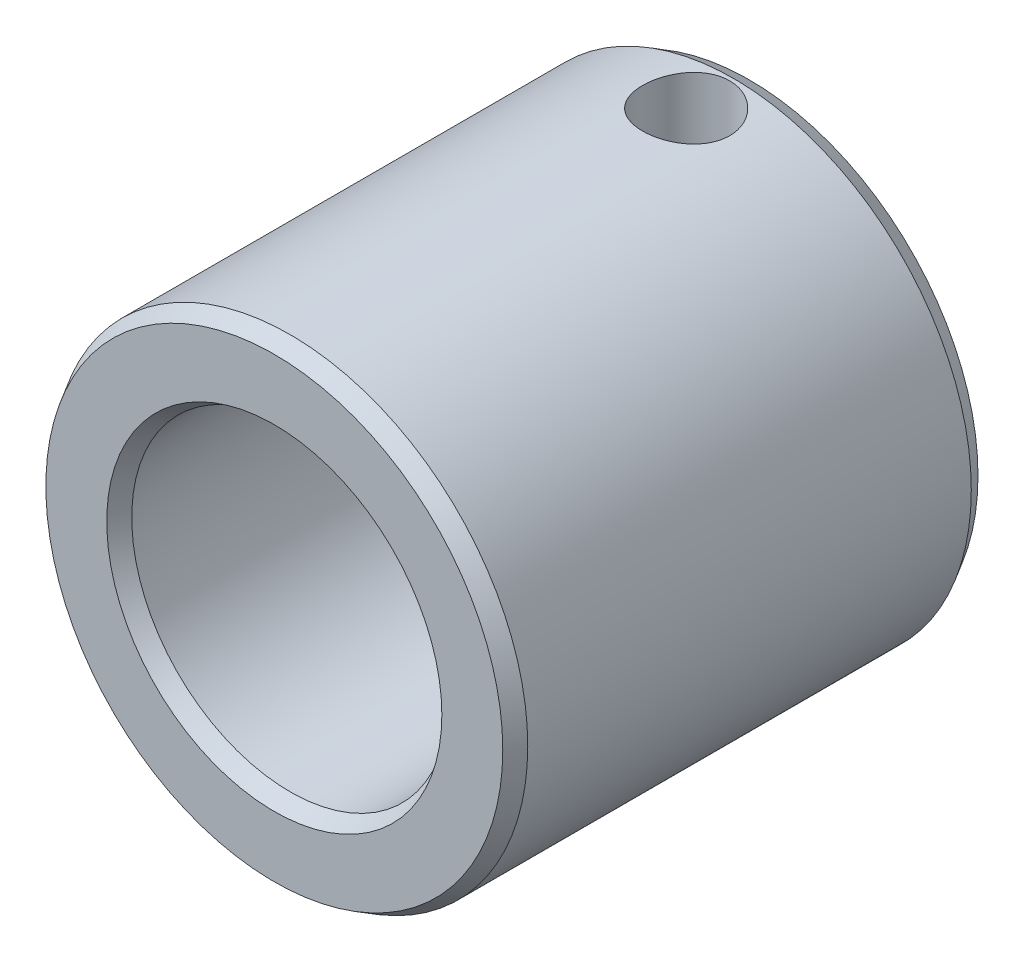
ISO-10303-21;
HEADER;
FILE_DESCRIPTION(('STEP AP214'),'2;1');
FILE_NAME('part.step','',(''),(''),'','','');
FILE_SCHEMA(('AUTOMOTIVE_DESIGN { 1 0 10303 214 1 1 1 1 }'));
ENDSEC;
DATA;
#1=APPLICATION_CONTEXT('core data for automotive mechanical design processes');
#2=APPLICATION_PROTOCOL_DEFINITION('international standard','automotive_design',2000,#1);
#3=PRODUCT_CONTEXT('',#1,'mechanical');
#4=PRODUCT('Part','Part','',(#3));
#5=PRODUCT_RELATED_PRODUCT_CATEGORY('part','',(#4));
#6=PRODUCT_DEFINITION_FORMATION('','',#4);
#7=PRODUCT_DEFINITION_CONTEXT('part definition',#1,'design');
#8=PRODUCT_DEFINITION('design','',#6,#7);
#9=PRODUCT_DEFINITION_SHAPE('','',#8);
#10=(LENGTH_UNIT() NAMED_UNIT(*) SI_UNIT(.MILLI.,.METRE.));
#11=(NAMED_UNIT(*) PLANE_ANGLE_UNIT() SI_UNIT($,.RADIAN.));
#12=(NAMED_UNIT(*) SI_UNIT($,.STERADIAN.) SOLID_ANGLE_UNIT());
#13=UNCERTAINTY_MEASURE_WITH_UNIT(LENGTH_MEASURE(1.E-05),#10,'distance_accuracy_value','');
#14=(GEOMETRIC_REPRESENTATION_CONTEXT(3) GLOBAL_UNCERTAINTY_ASSIGNED_CONTEXT((#13)) GLOBAL_UNIT_ASSIGNED_CONTEXT((#10,
#11,#12)) REPRESENTATION_CONTEXT('',''));
#15=CARTESIAN_POINT('',(0.,0.,0.));
#16=DIRECTION('',(0.,0.,1.));
#17=DIRECTION('',(1.,0.,0.));
#18=AXIS2_PLACEMENT_3D('',#15,#16,#17);
#19=CARTESIAN_POINT('',(0.,0.,34.824721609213));
#20=DIRECTION('',(0.,0.,1.));
#21=DIRECTION('',(1.,0.,0.));
#22=AXIS2_PLACEMENT_3D('',#19,#20,#21);
#23=CYLINDRICAL_SURFACE('',#22,10.);
#24=CARTESIAN_POINT('',(0.,0.,29.));
#25=DIRECTION('',(0.,0.,1.));
#26=DIRECTION('',(1.,0.,0.));
#27=AXIS2_PLACEMENT_3D('',#24,#25,#26);
#28=CIRCLE('',#27,10.);
#29=CARTESIAN_POINT('',(10.,0.,29.));
#30=VERTEX_POINT('',#29);
#31=EDGE_CURVE('E29',#30,#30,#28,.T.);
#32=ORIENTED_EDGE('',*,*,#31,.T.);
#33=EDGE_LOOP('',(#32));
#34=FACE_BOUND('',#33,.T.);
#35=CARTESIAN_POINT('',(0.,0.,1.));
#36=DIRECTION('',(0.,0.,1.));
#37=DIRECTION('',(1.,0.,0.));
#38=AXIS2_PLACEMENT_3D('',#35,#36,#37);
#39=CIRCLE('',#38,10.);
#40=CARTESIAN_POINT('',(10.,0.,1.));
#41=VERTEX_POINT('',#40);
#42=EDGE_CURVE('E34',#41,#41,#39,.T.);
#43=ORIENTED_EDGE('',*,*,#42,.F.);
#44=EDGE_LOOP('',(#43));
#45=FACE_BOUND('',#44,.T.);
#46=CARTESIAN_POINT('',(0.,10.,6.75));
#47=CARTESIAN_POINT('',(0.15142288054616,9.99999790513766,6.74999678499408));
#48=CARTESIAN_POINT('',(0.30287955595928,9.99652704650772,6.73745149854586));
#49=CARTESIAN_POINT('',(0.60141835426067,9.9830186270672,6.68769783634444));
#50=CARTESIAN_POINT('',(0.748498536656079,9.97297819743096,6.65047868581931));
#51=CARTESIAN_POINT('',(1.03393279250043,9.94743692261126,6.5526875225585));
#52=CARTESIAN_POINT('',(1.17229822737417,9.93194336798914,6.49214667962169));
#53=CARTESIAN_POINT('',(1.43691255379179,9.89712668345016,6.34954921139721));
#54=CARTESIAN_POINT('',(1.56316043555,9.87780323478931,6.26749079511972));
#55=CARTESIAN_POINT('',(1.80305227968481,9.83687707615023,6.082063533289));
#56=CARTESIAN_POINT('',(1.91635675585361,9.81523348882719,5.97826450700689));
#57=CARTESIAN_POINT('',(2.12418937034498,9.77236429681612,5.75322139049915));
#58=CARTESIAN_POINT('',(2.21871492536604,9.75113874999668,5.63197490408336));
#59=CARTESIAN_POINT('',(2.3879928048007,9.71108741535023,5.37273000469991));
#60=CARTESIAN_POINT('',(2.46234890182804,9.69231302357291,5.23446419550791));
#61=CARTESIAN_POINT('',(2.58662289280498,9.65989315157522,4.94679319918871));
#62=CARTESIAN_POINT('',(2.63654561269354,9.64624665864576,4.797390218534));
#63=CARTESIAN_POINT('',(2.70934583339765,9.62605068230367,4.49545889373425));
#64=CARTESIAN_POINT('',(2.73284141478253,9.61933931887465,4.34309067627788));
#65=CARTESIAN_POINT('',(2.75404817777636,9.61329031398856,4.03643877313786));
#66=CARTESIAN_POINT('',(2.75176451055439,9.61395119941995,3.88215547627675));
#67=CARTESIAN_POINT('',(2.72196703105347,9.62242747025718,3.58092425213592));
#68=CARTESIAN_POINT('',(2.69520726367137,9.63002901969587,3.43389475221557));
#69=CARTESIAN_POINT('',(2.61842742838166,9.6511868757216,3.14649742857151));
#70=CARTESIAN_POINT('',(2.56840539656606,9.66474368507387,3.00613016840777));
#71=CARTESIAN_POINT('',(2.4459209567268,9.6964683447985,2.73410558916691));
#72=CARTESIAN_POINT('',(2.37319900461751,9.71468906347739,2.60257156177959));
#73=CARTESIAN_POINT('',(2.20755990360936,9.75366083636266,2.3533115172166));
#74=CARTESIAN_POINT('',(2.11463855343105,9.77441241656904,2.23558838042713));
#75=CARTESIAN_POINT('',(1.90740929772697,9.81699239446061,2.01299085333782));
#76=CARTESIAN_POINT('',(1.79246989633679,9.83883313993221,1.90870584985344));
#77=CARTESIAN_POINT('',(1.54646529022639,9.8804850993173,1.7207665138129));
#78=CARTESIAN_POINT('',(1.41539936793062,9.90029622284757,1.63711309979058));
#79=CARTESIAN_POINT('',(1.13991171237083,9.93579173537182,1.49252903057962));
#80=CARTESIAN_POINT('',(0.995428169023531,9.95145560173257,1.43171077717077));
#81=CARTESIAN_POINT('',(0.69775688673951,9.97674362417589,1.33540050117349));
#82=CARTESIAN_POINT('',(0.544571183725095,9.98636918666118,1.29990258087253));
#83=CARTESIAN_POINT('',(0.238869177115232,9.99828101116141,1.25617934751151));
#84=CARTESIAN_POINT('',(0.0864756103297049,10.0007826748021,1.24715335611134));
#85=CARTESIAN_POINT('',(-0.217649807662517,9.9987871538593,1.25441110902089));
#86=CARTESIAN_POINT('',(-0.369381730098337,9.99429074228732,1.27069205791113));
#87=CARTESIAN_POINT('',(-0.664979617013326,9.97894393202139,1.32744676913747));
#88=CARTESIAN_POINT('',(-0.808939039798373,9.9682122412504,1.36746883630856));
#89=CARTESIAN_POINT('',(-1.0880827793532,9.94161719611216,1.47004065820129));
#90=CARTESIAN_POINT('',(-1.22326611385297,9.92575326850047,1.53259292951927));
#91=CARTESIAN_POINT('',(-1.48409215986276,9.89015496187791,1.67990036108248));
#92=CARTESIAN_POINT('',(-1.60948250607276,9.8703479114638,1.76508435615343));
#93=CARTESIAN_POINT('',(-1.84446827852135,9.82915015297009,1.95470256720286));
#94=CARTESIAN_POINT('',(-1.95406037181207,9.80775911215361,2.05914083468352));
#95=CARTESIAN_POINT('',(-2.15775026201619,9.76500318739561,2.28804742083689));
#96=CARTESIAN_POINT('',(-2.25128173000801,9.74365851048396,2.41302443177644));
#97=CARTESIAN_POINT('',(-2.41606367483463,9.70411480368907,2.67735585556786));
#98=CARTESIAN_POINT('',(-2.48731502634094,9.68591565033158,2.81670970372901));
#99=CARTESIAN_POINT('',(-2.60498194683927,9.65493519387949,3.1051872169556));
#100=CARTESIAN_POINT('',(-2.65153712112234,9.64212352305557,3.25425049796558));
#101=CARTESIAN_POINT('',(-2.71879365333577,9.62337795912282,3.55850589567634));
#102=CARTESIAN_POINT('',(-2.73950213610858,9.61744217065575,3.71369631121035));
#103=CARTESIAN_POINT('',(-2.75404886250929,9.6132857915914,4.01998313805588));
#104=CARTESIAN_POINT('',(-2.7488002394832,9.614803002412,4.17103325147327));
#105=CARTESIAN_POINT('',(-2.71371466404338,9.62476380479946,4.47000569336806));
#106=CARTESIAN_POINT('',(-2.68387842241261,9.63320719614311,4.6179281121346));
#107=CARTESIAN_POINT('',(-2.60100915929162,9.65590796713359,4.90521496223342));
#108=CARTESIAN_POINT('',(-2.54818121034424,9.67011387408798,5.04464290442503));
#109=CARTESIAN_POINT('',(-2.4209868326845,9.70273746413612,5.31276434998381));
#110=CARTESIAN_POINT('',(-2.34661683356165,9.72115584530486,5.44145606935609));
#111=CARTESIAN_POINT('',(-2.17573113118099,9.76084545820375,5.68878195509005));
#112=CARTESIAN_POINT('',(-2.07859788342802,9.78218767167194,5.80697809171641));
#113=CARTESIAN_POINT('',(-1.86610223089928,9.82493707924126,6.02568951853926));
#114=CARTESIAN_POINT('',(-1.75073533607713,9.84634428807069,6.12620044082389));
#115=CARTESIAN_POINT('',(-1.50182041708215,9.88740569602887,6.30898765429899));
#116=CARTESIAN_POINT('',(-1.36791284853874,9.907007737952,6.39078709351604));
#117=CARTESIAN_POINT('',(-1.08770978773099,9.94166772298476,6.53058644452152));
#118=CARTESIAN_POINT('',(-0.941421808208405,9.95672839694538,6.58860066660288));
#119=CARTESIAN_POINT('',(-0.66319943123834,9.97880995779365,6.67217272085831));
#120=CARTESIAN_POINT('',(-0.532391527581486,9.9866965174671,6.70128757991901));
#121=CARTESIAN_POINT('',(-0.267730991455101,9.9972921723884,6.74020155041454));
#122=CARTESIAN_POINT('',(-0.13387870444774,10.0000018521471,6.75000284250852));
#123=CARTESIAN_POINT('',(0.,10.,6.75));
#124=B_SPLINE_CURVE_WITH_KNOTS('',3,(#46,#47,#48,#49,#50,#51,#52,#53,#54,#55,#56,#57,#58,#59,
#60,#61,#62,#63,#64,#65,#66,#67,#68,#69,#70,#71,#72,#73,#74,#75,#76,#77,#78,#79,#80,#81,#82,#83,
#84,#85,#86,#87,#88,#89,#90,#91,#92,#93,#94,#95,#96,#97,#98,#99,#100,#101,#102,#103,#104,#105,
#106,#107,#108,#109,#110,#111,#112,#113,#114,#115,#116,#117,#118,#119,#120,#121,#122,#123),
.UNSPECIFIED.,.T.,.F.,(4,2,2,2,2,2,2,2,2,2,2,2,2,2,2,2,2,2,2,2,2,2,2,2,2,2,2,2,2,2,2,2,2,2,2,2,
2,2,4),(0.,0.45377748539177,0.907753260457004,1.36112438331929,1.81453325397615,
2.27794447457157,2.74141939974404,3.21343018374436,3.68534770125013,4.14598225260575,
4.60652476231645,5.0533402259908,5.50019341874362,5.95235548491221,6.40461168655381,
6.87259959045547,7.34060832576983,7.81089145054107,8.28106499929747,8.73686293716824,
9.19261053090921,9.63995333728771,10.0873461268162,10.5439096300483,11.0005693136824,
11.4709880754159,11.9413883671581,12.4091004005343,12.8766834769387,13.3279371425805,
13.7791777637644,14.2264735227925,14.6738434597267,15.1351456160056,15.5965615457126,
16.0686764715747,16.5405069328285,16.9417541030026,17.3429559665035),.UNSPECIFIED.);
#125=CARTESIAN_POINT('',(0.,10.,6.75));
#126=VERTEX_POINT('',#125);
#127=EDGE_CURVE('E49',#126,#126,#124,.T.);
#128=ORIENTED_EDGE('',*,*,#127,.T.);
#129=EDGE_LOOP('',(#128));
#130=FACE_BOUND('',#129,.T.);
#131=ADVANCED_FACE('F12',(#34,#45,#130),#23,.F.);
#132=CARTESIAN_POINT('',(0.,0.,34.824721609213));
#133=DIRECTION('',(0.,0.,1.));
#134=DIRECTION('',(1.,0.,0.));
#135=AXIS2_PLACEMENT_3D('',#132,#133,#134);
#136=CYLINDRICAL_SURFACE('',#135,15.);
#137=CARTESIAN_POINT('',(0.,0.,29.));
#138=DIRECTION('',(0.,0.,1.));
#139=DIRECTION('',(1.,0.,0.));
#140=AXIS2_PLACEMENT_3D('',#137,#138,#139);
#141=CIRCLE('',#140,15.);
#142=CARTESIAN_POINT('',(15.,0.,29.));
#143=VERTEX_POINT('',#142);
#144=EDGE_CURVE('E46',#143,#143,#141,.T.);
#145=ORIENTED_EDGE('',*,*,#144,.F.);
#146=EDGE_LOOP('',(#145));
#147=FACE_BOUND('',#146,.T.);
#148=CARTESIAN_POINT('',(0.,0.,1.));
#149=DIRECTION('',(0.,0.,1.));
#150=DIRECTION('',(1.,0.,0.));
#151=AXIS2_PLACEMENT_3D('',#148,#149,#150);
#152=CIRCLE('',#151,15.);
#153=CARTESIAN_POINT('',(15.,0.,1.));
#154=VERTEX_POINT('',#153);
#155=EDGE_CURVE('E43',#154,#154,#152,.T.);
#156=ORIENTED_EDGE('',*,*,#155,.T.);
#157=EDGE_LOOP('',(#156));
#158=FACE_BOUND('',#157,.T.);
#159=CARTESIAN_POINT('',(0.,15.,6.75));
#160=CARTESIAN_POINT('',(-0.153093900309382,14.9999972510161,6.74999408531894));
#161=CARTESIAN_POINT('',(-0.306265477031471,14.9976319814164,6.73717257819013));
#162=CARTESIAN_POINT('',(-0.608296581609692,14.9884243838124,6.68625588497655));
#163=CARTESIAN_POINT('',(-0.757152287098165,14.9815782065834,6.64813896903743));
#164=CARTESIAN_POINT('',(-1.04613957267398,14.9641750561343,6.54783432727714));
#165=CARTESIAN_POINT('',(-1.18627875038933,14.9536213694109,6.48566791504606));
#166=CARTESIAN_POINT('',(-1.45412377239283,14.9299573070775,6.3390885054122));
#167=CARTESIAN_POINT('',(-1.58183070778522,14.9168471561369,6.25467746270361));
#168=CARTESIAN_POINT('',(-1.82266517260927,14.8893503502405,6.06497648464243));
#169=CARTESIAN_POINT('',(-1.93562942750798,14.8749519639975,5.95948094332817));
#170=CARTESIAN_POINT('',(-2.1423598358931,14.846589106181,5.73104795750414));
#171=CARTESIAN_POINT('',(-2.23612464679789,14.8326246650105,5.60810929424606));
#172=CARTESIAN_POINT('',(-2.40246850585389,14.806596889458,5.34713263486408));
#173=CARTESIAN_POINT('',(-2.47488242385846,14.7945486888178,5.20898774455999));
#174=CARTESIAN_POINT('',(-2.59541207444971,14.7738823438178,4.922235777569));
#175=CARTESIAN_POINT('',(-2.64352980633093,14.7652639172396,4.77362956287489));
#176=CARTESIAN_POINT('',(-2.71357916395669,14.7525507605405,4.47191708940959));
#177=CARTESIAN_POINT('',(-2.73579495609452,14.7484069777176,4.31887891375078));
#178=CARTESIAN_POINT('',(-2.75429164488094,14.7449642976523,4.01119549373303));
#179=CARTESIAN_POINT('',(-2.75057476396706,14.7456649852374,3.8565503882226));
#180=CARTESIAN_POINT('',(-2.71754225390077,14.7517873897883,3.55209529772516));
#181=CARTESIAN_POINT('',(-2.68854893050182,14.7571496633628,3.40224897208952));
#182=CARTESIAN_POINT('',(-2.60629376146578,14.7718977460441,3.1095840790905));
#183=CARTESIAN_POINT('',(-2.55303092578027,14.7812837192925,2.96676579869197));
#184=CARTESIAN_POINT('',(-2.42343106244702,14.8030842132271,2.69126347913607));
#185=CARTESIAN_POINT('',(-2.34696312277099,14.8155158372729,2.5586424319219));
#186=CARTESIAN_POINT('',(-2.17321635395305,14.841995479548,2.3079923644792));
#187=CARTESIAN_POINT('',(-2.0759355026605,14.8560436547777,2.18996476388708));
#188=CARTESIAN_POINT('',(-1.86158278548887,14.8844329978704,1.96998902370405));
#189=CARTESIAN_POINT('',(-1.74423505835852,14.8987753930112,1.86830966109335));
#190=CARTESIAN_POINT('',(-1.4940048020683,14.925942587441,1.68604048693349));
#191=CARTESIAN_POINT('',(-1.36112212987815,14.9387673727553,1.6054508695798));
#192=CARTESIAN_POINT('',(-1.08331945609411,14.9614785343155,1.46761241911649));
#193=CARTESIAN_POINT('',(-0.9383857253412,14.9713614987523,1.4103906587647));
#194=CARTESIAN_POINT('',(-0.640742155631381,14.9870489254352,1.32117929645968));
#195=CARTESIAN_POINT('',(-0.488033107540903,14.9928538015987,1.28918713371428));
#196=CARTESIAN_POINT('',(-0.181487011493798,14.999674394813,1.25171517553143));
#197=CARTESIAN_POINT('',(-0.0276964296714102,15.0007566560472,1.24586696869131));
#198=CARTESIAN_POINT('',(0.27866544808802,14.9981935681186,1.25986196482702));
#199=CARTESIAN_POINT('',(0.431236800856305,14.9945484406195,1.27970396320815));
#200=CARTESIAN_POINT('',(0.729667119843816,14.9829815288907,1.34420979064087));
#201=CARTESIAN_POINT('',(0.87556754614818,14.9750917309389,1.38868804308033));
#202=CARTESIAN_POINT('',(1.15784057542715,14.9559164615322,1.501003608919));
#203=CARTESIAN_POINT('',(1.2942125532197,14.9446307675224,1.56884245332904));
#204=CARTESIAN_POINT('',(1.55513574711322,14.9197496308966,1.72677482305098));
#205=CARTESIAN_POINT('',(1.67954783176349,14.9061311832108,1.81709451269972));
#206=CARTESIAN_POINT('',(1.91158174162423,14.8781564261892,2.01711764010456));
#207=CARTESIAN_POINT('',(2.01920207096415,14.8638000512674,2.12682280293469));
#208=CARTESIAN_POINT('',(2.21599031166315,14.8357478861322,2.3641674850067));
#209=CARTESIAN_POINT('',(2.30490730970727,14.8220627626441,2.49201651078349));
#210=CARTESIAN_POINT('',(2.46000320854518,14.7971139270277,2.76105288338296));
#211=CARTESIAN_POINT('',(2.52618293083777,14.7858501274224,2.90223974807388));
#212=CARTESIAN_POINT('',(2.63356582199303,14.7671022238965,3.19329356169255));
#213=CARTESIAN_POINT('',(2.67488605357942,14.7596004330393,3.34311612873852));
#214=CARTESIAN_POINT('',(2.73173972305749,14.7491846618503,3.6477269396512));
#215=CARTESIAN_POINT('',(2.74727592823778,14.746270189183,3.80251464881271));
#216=CARTESIAN_POINT('',(2.75203112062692,14.7453832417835,4.11015028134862));
#217=CARTESIAN_POINT('',(2.74164570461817,14.7473364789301,4.26299201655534));
#218=CARTESIAN_POINT('',(2.69571632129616,14.7558005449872,4.5647121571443));
#219=CARTESIAN_POINT('',(2.66017248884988,14.7623113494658,4.71359058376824));
#220=CARTESIAN_POINT('',(2.56509900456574,14.77912629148,5.00295766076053));
#221=CARTESIAN_POINT('',(2.50561036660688,14.7894239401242,5.14346018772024));
#222=CARTESIAN_POINT('',(2.36437859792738,14.8126571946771,5.41255379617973));
#223=CARTESIAN_POINT('',(2.28263399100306,14.8255929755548,5.54114408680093));
#224=CARTESIAN_POINT('',(2.09782771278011,14.8528765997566,5.78474827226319));
#225=CARTESIAN_POINT('',(1.99447745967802,14.8672420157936,5.89954130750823));
#226=CARTESIAN_POINT('',(1.76999701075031,14.8956330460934,6.11028811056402));
#227=CARTESIAN_POINT('',(1.64886273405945,14.9096585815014,6.2062375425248));
#228=CARTESIAN_POINT('',(1.39101348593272,14.9359299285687,6.37733686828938));
#229=CARTESIAN_POINT('',(1.25417414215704,14.9481594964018,6.45230189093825));
#230=CARTESIAN_POINT('',(0.969665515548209,14.9693025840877,6.57805965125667));
#231=CARTESIAN_POINT('',(0.822006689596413,14.9782192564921,6.62887538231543));
#232=CARTESIAN_POINT('',(0.561569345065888,14.9898870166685,6.69442423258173));
#233=CARTESIAN_POINT('',(0.450325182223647,14.9936582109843,6.71523000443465));
#234=CARTESIAN_POINT('',(0.226068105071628,14.9987156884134,6.74301990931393));
#235=CARTESIAN_POINT('',(0.113055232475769,15.0000020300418,6.75000436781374));
#236=CARTESIAN_POINT('',(0.,15.,6.75));
#237=B_SPLINE_CURVE_WITH_KNOTS('',3,(#159,#160,#161,#162,#163,#164,#165,#166,#167,#168,#169,
#170,#171,#172,#173,#174,#175,#176,#177,#178,#179,#180,#181,#182,#183,#184,#185,#186,#187,#188,
#189,#190,#191,#192,#193,#194,#195,#196,#197,#198,#199,#200,#201,#202,#203,#204,#205,#206,#207,
#208,#209,#210,#211,#212,#213,#214,#215,#216,#217,#218,#219,#220,#221,#222,#223,#224,#225,#226,
#227,#228,#229,#230,#231,#232,#233,#234,#235,#236),.UNSPECIFIED.,.T.,.F.,(4,2,2,2,2,2,2,2,2,2,2,
2,2,2,2,2,2,2,2,2,2,2,2,2,2,2,2,2,2,2,2,2,2,2,2,2,2,2,4),(0.,0.45886829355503,0.918131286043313,
1.3769881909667,1.83580478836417,2.29933541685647,2.76289844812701,3.229957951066,
3.69697901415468,4.15882675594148,4.62063491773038,5.07663918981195,5.53266206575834,
5.9913070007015,6.44999651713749,6.91559042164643,7.38118861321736,7.8473247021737,
8.31341347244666,8.77291314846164,9.23239127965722,9.68845448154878,10.1445475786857,
10.6054289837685,11.0663514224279,11.5331103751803,11.9998524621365,12.4643791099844,
12.9288558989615,13.3862876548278,13.8437169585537,14.3003660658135,14.757045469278,
15.2202665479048,15.6835940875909,16.1508835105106,16.6177271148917,16.956595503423,
17.2954559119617),.UNSPECIFIED.);
#238=CARTESIAN_POINT('',(0.,15.,6.75));
#239=VERTEX_POINT('',#238);
#240=EDGE_CURVE('E16',#239,#239,#237,.T.);
#241=ORIENTED_EDGE('',*,*,#240,.T.);
#242=EDGE_LOOP('',(#241));
#243=FACE_BOUND('',#242,.T.);
#244=ADVANCED_FACE('F63',(#147,#158,#243),#136,.T.);
#245=CARTESIAN_POINT('',(0.,0.,29.));
#246=DIRECTION('',(0.,0.,-1.));
#247=DIRECTION('',(-1.,0.,0.));
#248=AXIS2_PLACEMENT_3D('',#245,#246,#247);
#249=CONICAL_SURFACE('',#248,15.,0.523598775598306);
#250=CARTESIAN_POINT('',(0.,0.,30.));
#251=DIRECTION('',(0.,0.,1.));
#252=DIRECTION('',(1.,0.,0.));
#253=AXIS2_PLACEMENT_3D('',#250,#251,#252);
#254=CIRCLE('',#253,14.4226497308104);
#255=CARTESIAN_POINT('',(14.4226497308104,0.,30.));
#256=VERTEX_POINT('',#255);
#257=EDGE_CURVE('E8',#256,#256,#254,.T.);
#258=ORIENTED_EDGE('',*,*,#257,.F.);
#259=EDGE_LOOP('',(#258));
#260=FACE_BOUND('',#259,.T.);
#261=ORIENTED_EDGE('',*,*,#144,.T.);
#262=EDGE_LOOP('',(#261));
#263=FACE_BOUND('',#262,.T.);
#264=ADVANCED_FACE('F14',(#260,#263),#249,.T.);
#265=CARTESIAN_POINT('',(0.,-10.5773502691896,30.));
#266=DIRECTION('',(0.,0.,1.));
#267=DIRECTION('',(1.,0.,0.));
#268=AXIS2_PLACEMENT_3D('',#265,#266,#267);
#269=PLANE('',#268);
#270=ORIENTED_EDGE('',*,*,#257,.T.);
#271=EDGE_LOOP('',(#270));
#272=FACE_BOUND('',#271,.T.);
#273=CARTESIAN_POINT('',(0.,0.,30.));
#274=DIRECTION('',(0.,0.,1.));
#275=DIRECTION('',(1.,0.,0.));
#276=AXIS2_PLACEMENT_3D('',#273,#274,#275);
#277=CIRCLE('',#276,10.5773502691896);
#278=CARTESIAN_POINT('',(10.5773502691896,0.,30.));
#279=VERTEX_POINT('',#278);
#280=EDGE_CURVE('E25',#279,#279,#277,.T.);
#281=ORIENTED_EDGE('',*,*,#280,.F.);
#282=EDGE_LOOP('',(#281));
#283=FACE_BOUND('',#282,.T.);
#284=ADVANCED_FACE('F84',(#272,#283),#269,.T.);
#285=CARTESIAN_POINT('',(0.,0.,29.));
#286=DIRECTION('',(0.,0.,1.));
#287=DIRECTION('',(1.,0.,0.));
#288=AXIS2_PLACEMENT_3D('',#285,#286,#287);
#289=CONICAL_SURFACE('',#288,10.,0.523598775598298);
#290=ORIENTED_EDGE('',*,*,#280,.T.);
#291=EDGE_LOOP('',(#290));
#292=FACE_BOUND('',#291,.T.);
#293=ORIENTED_EDGE('',*,*,#31,.F.);
#294=EDGE_LOOP('',(#293));
#295=FACE_BOUND('',#294,.T.);
#296=ADVANCED_FACE('F77',(#292,#295),#289,.F.);
#297=CARTESIAN_POINT('',(0.,0.,1.));
#298=DIRECTION('',(0.,0.,-1.));
#299=DIRECTION('',(-1.,0.,0.));
#300=AXIS2_PLACEMENT_3D('',#297,#298,#299);
#301=CONICAL_SURFACE('',#300,10.,0.523598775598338);
#302=CARTESIAN_POINT('',(0.,0.,0.));
#303=DIRECTION('',(0.,0.,1.));
#304=DIRECTION('',(1.,0.,0.));
#305=AXIS2_PLACEMENT_3D('',#302,#303,#304);
#306=CIRCLE('',#305,10.5773502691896);
#307=CARTESIAN_POINT('',(10.5773502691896,0.,0.));
#308=VERTEX_POINT('',#307);
#309=EDGE_CURVE('E37',#308,#308,#306,.T.);
#310=ORIENTED_EDGE('',*,*,#309,.F.);
#311=EDGE_LOOP('',(#310));
#312=FACE_BOUND('',#311,.T.);
#313=ORIENTED_EDGE('',*,*,#42,.T.);
#314=EDGE_LOOP('',(#313));
#315=FACE_BOUND('',#314,.T.);
#316=ADVANCED_FACE('F74',(#312,#315),#301,.F.);
#317=CARTESIAN_POINT('',(0.,-14.4226497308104,0.));
#318=DIRECTION('',(0.,0.,-1.));
#319=DIRECTION('',(-1.,0.,0.));
#320=AXIS2_PLACEMENT_3D('',#317,#318,#319);
#321=PLANE('',#320);
#322=ORIENTED_EDGE('',*,*,#309,.T.);
#323=EDGE_LOOP('',(#322));
#324=FACE_BOUND('',#323,.T.);
#325=CARTESIAN_POINT('',(0.,0.,0.));
#326=DIRECTION('',(0.,0.,1.));
#327=DIRECTION('',(1.,0.,0.));
#328=AXIS2_PLACEMENT_3D('',#325,#326,#327);
#329=CIRCLE('',#328,14.4226497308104);
#330=CARTESIAN_POINT('',(14.4226497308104,0.,0.));
#331=VERTEX_POINT('',#330);
#332=EDGE_CURVE('E40',#331,#331,#329,.T.);
#333=ORIENTED_EDGE('',*,*,#332,.F.);
#334=EDGE_LOOP('',(#333));
#335=FACE_BOUND('',#334,.T.);
#336=ADVANCED_FACE('F71',(#324,#335),#321,.T.);
#337=CARTESIAN_POINT('',(0.,0.,1.));
#338=DIRECTION('',(0.,0.,1.));
#339=DIRECTION('',(1.,0.,0.));
#340=AXIS2_PLACEMENT_3D('',#337,#338,#339);
#341=CONICAL_SURFACE('',#340,15.,0.523598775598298);
#342=ORIENTED_EDGE('',*,*,#332,.T.);
#343=EDGE_LOOP('',(#342));
#344=FACE_BOUND('',#343,.T.);
#345=ORIENTED_EDGE('',*,*,#155,.F.);
#346=EDGE_LOOP('',(#345));
#347=FACE_BOUND('',#346,.T.);
#348=ADVANCED_FACE('F61',(#344,#347),#341,.T.);
#349=CARTESIAN_POINT('',(0.,20.,4.));
#350=DIRECTION('',(0.,-1.,0.));
#351=DIRECTION('',(0.,0.,1.));
#352=AXIS2_PLACEMENT_3D('',#349,#350,#351);
#353=CYLINDRICAL_SURFACE('',#352,2.75);
#354=ORIENTED_EDGE('',*,*,#127,.F.);
#355=EDGE_LOOP('',(#354));
#356=FACE_BOUND('',#355,.T.);
#357=ORIENTED_EDGE('',*,*,#240,.F.);
#358=EDGE_LOOP('',(#357));
#359=FACE_BOUND('',#358,.T.);
#360=ADVANCED_FACE('F58',(#356,#359),#353,.F.);
#361=CLOSED_SHELL('',(#131,#244,#264,#284,#296,#316,#336,#348,#360));
#362=MANIFOLD_SOLID_BREP('B1',#361);
#363=ADVANCED_BREP_SHAPE_REPRESENTATION('',(#18,#362),#14);
#364=SHAPE_DEFINITION_REPRESENTATION(#9,#363);
ENDSEC;
END-ISO-10303-21;
